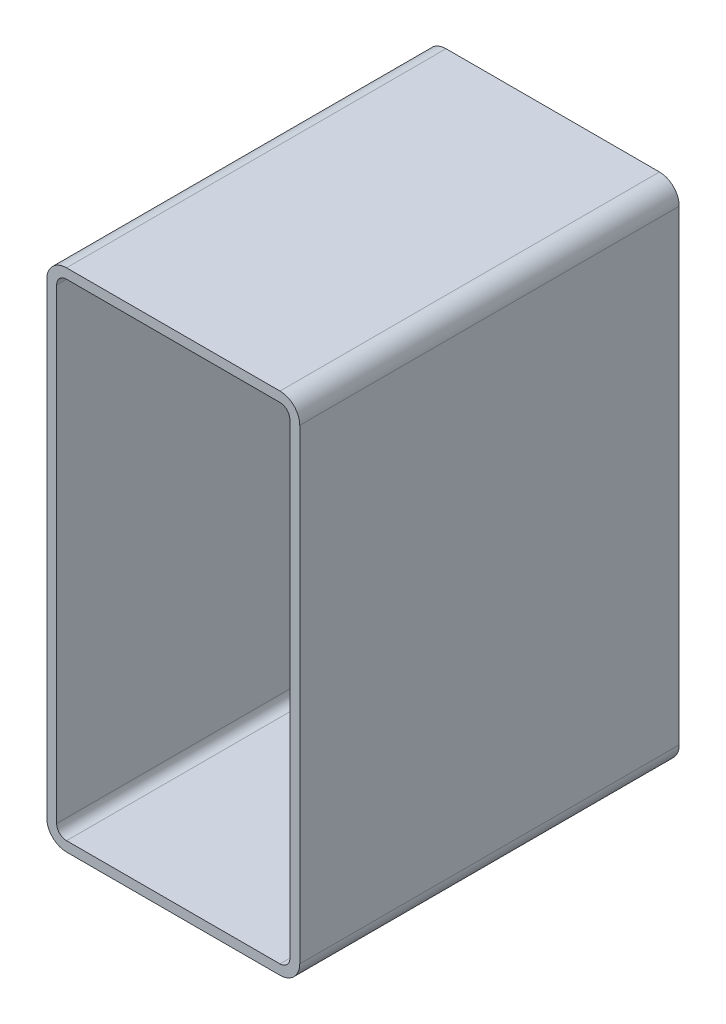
ISO-10303-21;
HEADER;
FILE_DESCRIPTION(('STEP AP214'),'2;1');
FILE_NAME('part.step','',(''),(''),'','','');
FILE_SCHEMA(('AUTOMOTIVE_DESIGN { 1 0 10303 214 1 1 1 1 }'));
ENDSEC;
DATA;
#1=APPLICATION_CONTEXT('core data for automotive mechanical design processes');
#2=APPLICATION_PROTOCOL_DEFINITION('international standard','automotive_design',2000,#1);
#3=PRODUCT_CONTEXT('',#1,'mechanical');
#4=PRODUCT('Part','Part','',(#3));
#5=PRODUCT_RELATED_PRODUCT_CATEGORY('part','',(#4));
#6=PRODUCT_DEFINITION_FORMATION('','',#4);
#7=PRODUCT_DEFINITION_CONTEXT('part definition',#1,'design');
#8=PRODUCT_DEFINITION('design','',#6,#7);
#9=PRODUCT_DEFINITION_SHAPE('','',#8);
#10=(LENGTH_UNIT() NAMED_UNIT(*) SI_UNIT(.MILLI.,.METRE.));
#11=(NAMED_UNIT(*) PLANE_ANGLE_UNIT() SI_UNIT($,.RADIAN.));
#12=(NAMED_UNIT(*) SI_UNIT($,.STERADIAN.) SOLID_ANGLE_UNIT());
#13=UNCERTAINTY_MEASURE_WITH_UNIT(LENGTH_MEASURE(1.E-05),#10,'distance_accuracy_value','');
#14=(GEOMETRIC_REPRESENTATION_CONTEXT(3) GLOBAL_UNCERTAINTY_ASSIGNED_CONTEXT((#13)) GLOBAL_UNIT_ASSIGNED_CONTEXT((#10,
#11,#12)) REPRESENTATION_CONTEXT('',''));
#15=CARTESIAN_POINT('',(0.,0.,0.));
#16=DIRECTION('',(0.,0.,1.));
#17=DIRECTION('',(1.,0.,0.));
#18=AXIS2_PLACEMENT_3D('',#15,#16,#17);
#19=CARTESIAN_POINT('',(17.2659404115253,392.307862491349,304.8));
#20=DIRECTION('',(0.,0.,1.));
#21=DIRECTION('',(1.,0.,0.));
#22=AXIS2_PLACEMENT_3D('',#19,#20,#21);
#23=PLANE('',#22);
#24=CARTESIAN_POINT('',(17.2659404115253,392.307862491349,304.8));
#25=DIRECTION('',(0.,0.,1.));
#26=DIRECTION('',(1.,0.,0.));
#27=AXIS2_PLACEMENT_3D('',#24,#25,#26);
#28=CIRCLE('',#27,15.875);
#29=CARTESIAN_POINT('',(17.2659404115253,408.182862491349,304.8));
#30=VERTEX_POINT('',#29);
#31=CARTESIAN_POINT('',(1.3909404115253,392.307862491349,304.8));
#32=VERTEX_POINT('',#31);
#33=EDGE_CURVE('E211',#30,#32,#28,.T.);
#34=ORIENTED_EDGE('',*,*,#33,.T.);
#35=DIRECTION('',(0.,-1.,0.));
#36=VECTOR('',#35,1.);
#37=CARTESIAN_POINT('',(1.3909404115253,17.6578624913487,304.8));
#38=LINE('',#37,#36);
#39=CARTESIAN_POINT('',(1.3909404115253,17.6578624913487,304.8));
#40=VERTEX_POINT('',#39);
#41=EDGE_CURVE('E214',#32,#40,#38,.T.);
#42=ORIENTED_EDGE('',*,*,#41,.T.);
#43=CARTESIAN_POINT('',(17.2659404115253,17.6578624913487,304.8));
#44=DIRECTION('',(0.,0.,1.));
#45=DIRECTION('',(1.,0.,0.));
#46=AXIS2_PLACEMENT_3D('',#43,#44,#45);
#47=CIRCLE('',#46,15.875);
#48=CARTESIAN_POINT('',(17.2659404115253,1.78286249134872,304.8));
#49=VERTEX_POINT('',#48);
#50=EDGE_CURVE('E217',#40,#49,#47,.T.);
#51=ORIENTED_EDGE('',*,*,#50,.T.);
#52=DIRECTION('',(1.,0.,0.));
#53=VECTOR('',#52,1.);
#54=CARTESIAN_POINT('',(188.715940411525,1.78286249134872,304.8));
#55=LINE('',#54,#53);
#56=CARTESIAN_POINT('',(188.715940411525,1.7828624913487,304.8));
#57=VERTEX_POINT('',#56);
#58=EDGE_CURVE('E219',#49,#57,#55,.T.);
#59=ORIENTED_EDGE('',*,*,#58,.T.);
#60=CARTESIAN_POINT('',(188.715940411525,17.6578624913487,304.8));
#61=DIRECTION('',(0.,0.,1.));
#62=DIRECTION('',(1.,0.,0.));
#63=AXIS2_PLACEMENT_3D('',#60,#61,#62);
#64=CIRCLE('',#63,15.875);
#65=CARTESIAN_POINT('',(204.590940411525,17.6578624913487,304.8));
#66=VERTEX_POINT('',#65);
#67=EDGE_CURVE('E221',#57,#66,#64,.T.);
#68=ORIENTED_EDGE('',*,*,#67,.T.);
#69=DIRECTION('',(0.,1.,0.));
#70=VECTOR('',#69,1.);
#71=CARTESIAN_POINT('',(204.590940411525,392.307862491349,304.8));
#72=LINE('',#71,#70);
#73=CARTESIAN_POINT('',(204.590940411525,392.307862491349,304.8));
#74=VERTEX_POINT('',#73);
#75=EDGE_CURVE('E223',#66,#74,#72,.T.);
#76=ORIENTED_EDGE('',*,*,#75,.T.);
#77=CARTESIAN_POINT('',(188.715940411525,392.307862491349,304.8));
#78=DIRECTION('',(0.,0.,1.));
#79=DIRECTION('',(1.,0.,0.));
#80=AXIS2_PLACEMENT_3D('',#77,#78,#79);
#81=CIRCLE('',#80,15.875);
#82=CARTESIAN_POINT('',(188.715940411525,408.182862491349,304.8));
#83=VERTEX_POINT('',#82);
#84=EDGE_CURVE('E225',#74,#83,#81,.T.);
#85=ORIENTED_EDGE('',*,*,#84,.T.);
#86=DIRECTION('',(-1.,0.,0.));
#87=VECTOR('',#86,1.);
#88=CARTESIAN_POINT('',(17.2659404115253,408.182862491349,304.8));
#89=LINE('',#88,#87);
#90=EDGE_CURVE('E227',#83,#30,#89,.T.);
#91=ORIENTED_EDGE('',*,*,#90,.T.);
#92=EDGE_LOOP('',(#34,#42,#51,#59,#68,#76,#85,#91));
#93=FACE_BOUND('',#92,.T.);
#94=DIRECTION('',(0.,-1.,0.));
#95=VECTOR('',#94,1.);
#96=CARTESIAN_POINT('',(9.3284404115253,17.6578624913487,304.8));
#97=LINE('',#96,#95);
#98=CARTESIAN_POINT('',(9.3284404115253,392.307862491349,304.8));
#99=VERTEX_POINT('',#98);
#100=CARTESIAN_POINT('',(9.3284404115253,17.6578624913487,304.8));
#101=VERTEX_POINT('',#100);
#102=EDGE_CURVE('E154',#99,#101,#97,.T.);
#103=ORIENTED_EDGE('',*,*,#102,.F.);
#104=CARTESIAN_POINT('',(17.2659404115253,392.307862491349,304.8));
#105=DIRECTION('',(0.,0.,1.));
#106=DIRECTION('',(1.,0.,0.));
#107=AXIS2_PLACEMENT_3D('',#104,#105,#106);
#108=CIRCLE('',#107,7.9375);
#109=CARTESIAN_POINT('',(17.2659404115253,400.245362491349,304.8));
#110=VERTEX_POINT('',#109);
#111=EDGE_CURVE('E146',#110,#99,#108,.T.);
#112=ORIENTED_EDGE('',*,*,#111,.F.);
#113=DIRECTION('',(-1.,0.,0.));
#114=VECTOR('',#113,1.);
#115=CARTESIAN_POINT('',(17.2659404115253,400.245362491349,304.8));
#116=LINE('',#115,#114);
#117=CARTESIAN_POINT('',(188.715940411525,400.245362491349,304.8));
#118=VERTEX_POINT('',#117);
#119=EDGE_CURVE('E179',#118,#110,#116,.T.);
#120=ORIENTED_EDGE('',*,*,#119,.F.);
#121=CARTESIAN_POINT('',(188.715940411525,392.307862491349,304.8));
#122=DIRECTION('',(0.,0.,1.));
#123=DIRECTION('',(1.,0.,0.));
#124=AXIS2_PLACEMENT_3D('',#121,#122,#123);
#125=CIRCLE('',#124,7.93750000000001);
#126=CARTESIAN_POINT('',(196.653440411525,392.307862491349,304.8));
#127=VERTEX_POINT('',#126);
#128=EDGE_CURVE('E177',#127,#118,#125,.T.);
#129=ORIENTED_EDGE('',*,*,#128,.F.);
#130=DIRECTION('',(0.,1.,0.));
#131=VECTOR('',#130,1.);
#132=CARTESIAN_POINT('',(196.653440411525,392.307862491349,304.8));
#133=LINE('',#132,#131);
#134=CARTESIAN_POINT('',(196.653440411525,17.6578624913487,304.8));
#135=VERTEX_POINT('',#134);
#136=EDGE_CURVE('E175',#135,#127,#133,.T.);
#137=ORIENTED_EDGE('',*,*,#136,.F.);
#138=CARTESIAN_POINT('',(188.715940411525,17.6578624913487,304.8));
#139=DIRECTION('',(0.,0.,1.));
#140=DIRECTION('',(1.,0.,0.));
#141=AXIS2_PLACEMENT_3D('',#138,#139,#140);
#142=CIRCLE('',#141,7.93750000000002);
#143=CARTESIAN_POINT('',(188.715940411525,9.7203624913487,304.8));
#144=VERTEX_POINT('',#143);
#145=EDGE_CURVE('E173',#144,#135,#142,.T.);
#146=ORIENTED_EDGE('',*,*,#145,.F.);
#147=DIRECTION('',(1.,0.,0.));
#148=VECTOR('',#147,1.);
#149=CARTESIAN_POINT('',(188.715940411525,9.72036249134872,304.8));
#150=LINE('',#149,#148);
#151=CARTESIAN_POINT('',(17.2659404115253,9.72036249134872,304.8));
#152=VERTEX_POINT('',#151);
#153=EDGE_CURVE('E169',#152,#144,#150,.T.);
#154=ORIENTED_EDGE('',*,*,#153,.F.);
#155=CARTESIAN_POINT('',(17.2659404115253,17.6578624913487,304.8));
#156=DIRECTION('',(0.,0.,1.));
#157=DIRECTION('',(1.,0.,0.));
#158=AXIS2_PLACEMENT_3D('',#155,#156,#157);
#159=CIRCLE('',#158,7.9375);
#160=EDGE_CURVE('E167',#101,#152,#159,.T.);
#161=ORIENTED_EDGE('',*,*,#160,.F.);
#162=EDGE_LOOP('',(#103,#112,#120,#129,#137,#146,#154,#161));
#163=FACE_BOUND('',#162,.T.);
#164=ADVANCED_FACE('F33',(#93,#163),#23,.T.);
#165=CARTESIAN_POINT('',(17.2659404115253,392.307862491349,0.));
#166=DIRECTION('',(0.,0.,1.));
#167=DIRECTION('',(1.,0.,0.));
#168=AXIS2_PLACEMENT_3D('',#165,#166,#167);
#169=PLANE('',#168);
#170=CARTESIAN_POINT('',(17.2659404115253,392.307862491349,0.));
#171=DIRECTION('',(0.,0.,1.));
#172=DIRECTION('',(1.,0.,0.));
#173=AXIS2_PLACEMENT_3D('',#170,#171,#172);
#174=CIRCLE('',#173,15.875);
#175=CARTESIAN_POINT('',(17.2659404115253,408.182862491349,0.));
#176=VERTEX_POINT('',#175);
#177=CARTESIAN_POINT('',(1.3909404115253,392.307862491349,0.));
#178=VERTEX_POINT('',#177);
#179=EDGE_CURVE('E162',#176,#178,#174,.T.);
#180=ORIENTED_EDGE('',*,*,#179,.F.);
#181=DIRECTION('',(-1.,0.,0.));
#182=VECTOR('',#181,1.);
#183=CARTESIAN_POINT('',(17.2659404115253,408.182862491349,0.));
#184=LINE('',#183,#182);
#185=CARTESIAN_POINT('',(188.715940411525,408.182862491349,0.));
#186=VERTEX_POINT('',#185);
#187=EDGE_CURVE('E215',#186,#176,#184,.T.);
#188=ORIENTED_EDGE('',*,*,#187,.F.);
#189=CARTESIAN_POINT('',(188.715940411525,392.307862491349,0.));
#190=DIRECTION('',(0.,0.,1.));
#191=DIRECTION('',(1.,0.,0.));
#192=AXIS2_PLACEMENT_3D('',#189,#190,#191);
#193=CIRCLE('',#192,15.875);
#194=CARTESIAN_POINT('',(204.590940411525,392.307862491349,0.));
#195=VERTEX_POINT('',#194);
#196=EDGE_CURVE('E242',#195,#186,#193,.T.);
#197=ORIENTED_EDGE('',*,*,#196,.F.);
#198=DIRECTION('',(0.,1.,0.));
#199=VECTOR('',#198,1.);
#200=CARTESIAN_POINT('',(204.590940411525,392.307862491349,0.));
#201=LINE('',#200,#199);
#202=CARTESIAN_POINT('',(204.590940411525,17.6578624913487,0.));
#203=VERTEX_POINT('',#202);
#204=EDGE_CURVE('E240',#203,#195,#201,.T.);
#205=ORIENTED_EDGE('',*,*,#204,.F.);
#206=CARTESIAN_POINT('',(188.715940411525,17.6578624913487,0.));
#207=DIRECTION('',(0.,0.,1.));
#208=DIRECTION('',(1.,0.,0.));
#209=AXIS2_PLACEMENT_3D('',#206,#207,#208);
#210=CIRCLE('',#209,15.875);
#211=CARTESIAN_POINT('',(188.715940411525,1.7828624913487,0.));
#212=VERTEX_POINT('',#211);
#213=EDGE_CURVE('E238',#212,#203,#210,.T.);
#214=ORIENTED_EDGE('',*,*,#213,.F.);
#215=DIRECTION('',(1.,0.,0.));
#216=VECTOR('',#215,1.);
#217=CARTESIAN_POINT('',(188.715940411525,1.78286249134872,0.));
#218=LINE('',#217,#216);
#219=CARTESIAN_POINT('',(17.2659404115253,1.78286249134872,0.));
#220=VERTEX_POINT('',#219);
#221=EDGE_CURVE('E236',#220,#212,#218,.T.);
#222=ORIENTED_EDGE('',*,*,#221,.F.);
#223=CARTESIAN_POINT('',(17.2659404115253,17.6578624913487,0.));
#224=DIRECTION('',(0.,0.,1.));
#225=DIRECTION('',(1.,0.,0.));
#226=AXIS2_PLACEMENT_3D('',#223,#224,#225);
#227=CIRCLE('',#226,15.875);
#228=CARTESIAN_POINT('',(1.3909404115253,17.6578624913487,0.));
#229=VERTEX_POINT('',#228);
#230=EDGE_CURVE('E234',#229,#220,#227,.T.);
#231=ORIENTED_EDGE('',*,*,#230,.F.);
#232=DIRECTION('',(0.,-1.,0.));
#233=VECTOR('',#232,1.);
#234=CARTESIAN_POINT('',(1.3909404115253,17.6578624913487,0.));
#235=LINE('',#234,#233);
#236=EDGE_CURVE('E232',#178,#229,#235,.T.);
#237=ORIENTED_EDGE('',*,*,#236,.F.);
#238=EDGE_LOOP('',(#180,#188,#197,#205,#214,#222,#231,#237));
#239=FACE_BOUND('',#238,.T.);
#240=CARTESIAN_POINT('',(17.2659404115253,392.307862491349,0.));
#241=DIRECTION('',(0.,0.,1.));
#242=DIRECTION('',(1.,0.,0.));
#243=AXIS2_PLACEMENT_3D('',#240,#241,#242);
#244=CIRCLE('',#243,7.9375);
#245=CARTESIAN_POINT('',(17.2659404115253,400.245362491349,0.));
#246=VERTEX_POINT('',#245);
#247=CARTESIAN_POINT('',(9.3284404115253,392.307862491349,0.));
#248=VERTEX_POINT('',#247);
#249=EDGE_CURVE('E56',#246,#248,#244,.T.);
#250=ORIENTED_EDGE('',*,*,#249,.T.);
#251=DIRECTION('',(0.,-1.,0.));
#252=VECTOR('',#251,1.);
#253=CARTESIAN_POINT('',(9.3284404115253,17.6578624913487,0.));
#254=LINE('',#253,#252);
#255=CARTESIAN_POINT('',(9.3284404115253,17.6578624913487,0.));
#256=VERTEX_POINT('',#255);
#257=EDGE_CURVE('E161',#248,#256,#254,.T.);
#258=ORIENTED_EDGE('',*,*,#257,.T.);
#259=CARTESIAN_POINT('',(17.2659404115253,17.6578624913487,0.));
#260=DIRECTION('',(0.,0.,1.));
#261=DIRECTION('',(1.,0.,0.));
#262=AXIS2_PLACEMENT_3D('',#259,#260,#261);
#263=CIRCLE('',#262,7.9375);
#264=CARTESIAN_POINT('',(17.2659404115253,9.72036249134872,0.));
#265=VERTEX_POINT('',#264);
#266=EDGE_CURVE('E183',#256,#265,#263,.T.);
#267=ORIENTED_EDGE('',*,*,#266,.T.);
#268=DIRECTION('',(1.,0.,0.));
#269=VECTOR('',#268,1.);
#270=CARTESIAN_POINT('',(188.715940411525,9.72036249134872,0.));
#271=LINE('',#270,#269);
#272=CARTESIAN_POINT('',(188.715940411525,9.7203624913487,0.));
#273=VERTEX_POINT('',#272);
#274=EDGE_CURVE('E186',#265,#273,#271,.T.);
#275=ORIENTED_EDGE('',*,*,#274,.T.);
#276=CARTESIAN_POINT('',(188.715940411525,17.6578624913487,0.));
#277=DIRECTION('',(0.,0.,1.));
#278=DIRECTION('',(1.,0.,0.));
#279=AXIS2_PLACEMENT_3D('',#276,#277,#278);
#280=CIRCLE('',#279,7.93750000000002);
#281=CARTESIAN_POINT('',(196.653440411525,17.6578624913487,0.));
#282=VERTEX_POINT('',#281);
#283=EDGE_CURVE('E189',#273,#282,#280,.T.);
#284=ORIENTED_EDGE('',*,*,#283,.T.);
#285=DIRECTION('',(0.,1.,0.));
#286=VECTOR('',#285,1.);
#287=CARTESIAN_POINT('',(196.653440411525,392.307862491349,0.));
#288=LINE('',#287,#286);
#289=CARTESIAN_POINT('',(196.653440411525,392.307862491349,0.));
#290=VERTEX_POINT('',#289);
#291=EDGE_CURVE('E192',#282,#290,#288,.T.);
#292=ORIENTED_EDGE('',*,*,#291,.T.);
#293=CARTESIAN_POINT('',(188.715940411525,392.307862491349,0.));
#294=DIRECTION('',(0.,0.,1.));
#295=DIRECTION('',(1.,0.,0.));
#296=AXIS2_PLACEMENT_3D('',#293,#294,#295);
#297=CIRCLE('',#296,7.93750000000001);
#298=CARTESIAN_POINT('',(188.715940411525,400.245362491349,0.));
#299=VERTEX_POINT('',#298);
#300=EDGE_CURVE('E195',#290,#299,#297,.T.);
#301=ORIENTED_EDGE('',*,*,#300,.T.);
#302=DIRECTION('',(-1.,0.,0.));
#303=VECTOR('',#302,1.);
#304=CARTESIAN_POINT('',(17.2659404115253,400.245362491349,0.));
#305=LINE('',#304,#303);
#306=EDGE_CURVE('E155',#299,#246,#305,.T.);
#307=ORIENTED_EDGE('',*,*,#306,.T.);
#308=EDGE_LOOP('',(#250,#258,#267,#275,#284,#292,#301,#307));
#309=FACE_BOUND('',#308,.T.);
#310=ADVANCED_FACE('F272',(#239,#309),#169,.F.);
#311=CARTESIAN_POINT('',(17.2659404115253,392.307862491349,304.8));
#312=DIRECTION('',(0.,0.,-1.));
#313=DIRECTION('',(-1.,0.,0.));
#314=AXIS2_PLACEMENT_3D('',#311,#312,#313);
#315=CYLINDRICAL_SURFACE('',#314,15.875);
#316=ORIENTED_EDGE('',*,*,#179,.T.);
#317=DIRECTION('',(0.,0.,-1.));
#318=VECTOR('',#317,1.);
#319=CARTESIAN_POINT('',(1.3909404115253,392.307862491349,304.8));
#320=LINE('',#319,#318);
#321=EDGE_CURVE('E11',#32,#178,#320,.T.);
#322=ORIENTED_EDGE('',*,*,#321,.F.);
#323=ORIENTED_EDGE('',*,*,#33,.F.);
#324=DIRECTION('',(0.,0.,-1.));
#325=VECTOR('',#324,1.);
#326=CARTESIAN_POINT('',(17.2659404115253,408.182862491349,304.8));
#327=LINE('',#326,#325);
#328=EDGE_CURVE('E229',#30,#176,#327,.T.);
#329=ORIENTED_EDGE('',*,*,#328,.T.);
#330=EDGE_LOOP('',(#316,#322,#323,#329));
#331=FACE_BOUND('',#330,.T.);
#332=ADVANCED_FACE('F35',(#331),#315,.T.);
#333=CARTESIAN_POINT('',(1.3909404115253,17.6578624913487,304.8));
#334=DIRECTION('',(1.,0.,0.));
#335=DIRECTION('',(0.,0.,-1.));
#336=AXIS2_PLACEMENT_3D('',#333,#334,#335);
#337=PLANE('',#336);
#338=ORIENTED_EDGE('',*,*,#236,.T.);
#339=DIRECTION('',(0.,0.,-1.));
#340=VECTOR('',#339,1.);
#341=CARTESIAN_POINT('',(1.3909404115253,17.6578624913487,304.8));
#342=LINE('',#341,#340);
#343=EDGE_CURVE('E41',#40,#229,#342,.T.);
#344=ORIENTED_EDGE('',*,*,#343,.F.);
#345=ORIENTED_EDGE('',*,*,#41,.F.);
#346=ORIENTED_EDGE('',*,*,#321,.T.);
#347=EDGE_LOOP('',(#338,#344,#345,#346));
#348=FACE_BOUND('',#347,.T.);
#349=ADVANCED_FACE('F289',(#348),#337,.F.);
#350=CARTESIAN_POINT('',(17.2659404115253,17.6578624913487,304.8));
#351=DIRECTION('',(0.,0.,-1.));
#352=DIRECTION('',(-1.,0.,0.));
#353=AXIS2_PLACEMENT_3D('',#350,#351,#352);
#354=CYLINDRICAL_SURFACE('',#353,15.875);
#355=ORIENTED_EDGE('',*,*,#230,.T.);
#356=DIRECTION('',(0.,0.,-1.));
#357=VECTOR('',#356,1.);
#358=CARTESIAN_POINT('',(17.2659404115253,1.78286249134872,304.8));
#359=LINE('',#358,#357);
#360=EDGE_CURVE('E259',#49,#220,#359,.T.);
#361=ORIENTED_EDGE('',*,*,#360,.F.);
#362=ORIENTED_EDGE('',*,*,#50,.F.);
#363=ORIENTED_EDGE('',*,*,#343,.T.);
#364=EDGE_LOOP('',(#355,#361,#362,#363));
#365=FACE_BOUND('',#364,.T.);
#366=ADVANCED_FACE('F266',(#365),#354,.T.);
#367=CARTESIAN_POINT('',(188.715940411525,1.78286249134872,304.8));
#368=DIRECTION('',(0.,1.,0.));
#369=DIRECTION('',(0.,0.,1.));
#370=AXIS2_PLACEMENT_3D('',#367,#368,#369);
#371=PLANE('',#370);
#372=ORIENTED_EDGE('',*,*,#221,.T.);
#373=DIRECTION('',(0.,0.,-1.));
#374=VECTOR('',#373,1.);
#375=CARTESIAN_POINT('',(188.715940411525,1.7828624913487,304.8));
#376=LINE('',#375,#374);
#377=EDGE_CURVE('E256',#57,#212,#376,.T.);
#378=ORIENTED_EDGE('',*,*,#377,.F.);
#379=ORIENTED_EDGE('',*,*,#58,.F.);
#380=ORIENTED_EDGE('',*,*,#360,.T.);
#381=EDGE_LOOP('',(#372,#378,#379,#380));
#382=FACE_BOUND('',#381,.T.);
#383=ADVANCED_FACE('F278',(#382),#371,.F.);
#384=CARTESIAN_POINT('',(188.715940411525,17.6578624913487,304.8));
#385=DIRECTION('',(0.,0.,-1.));
#386=DIRECTION('',(-1.,0.,0.));
#387=AXIS2_PLACEMENT_3D('',#384,#385,#386);
#388=CYLINDRICAL_SURFACE('',#387,15.875);
#389=ORIENTED_EDGE('',*,*,#213,.T.);
#390=DIRECTION('',(0.,0.,-1.));
#391=VECTOR('',#390,1.);
#392=CARTESIAN_POINT('',(204.590940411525,17.6578624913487,304.8));
#393=LINE('',#392,#391);
#394=EDGE_CURVE('E253',#66,#203,#393,.T.);
#395=ORIENTED_EDGE('',*,*,#394,.F.);
#396=ORIENTED_EDGE('',*,*,#67,.F.);
#397=ORIENTED_EDGE('',*,*,#377,.T.);
#398=EDGE_LOOP('',(#389,#395,#396,#397));
#399=FACE_BOUND('',#398,.T.);
#400=ADVANCED_FACE('F282',(#399),#388,.T.);
#401=CARTESIAN_POINT('',(204.590940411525,392.307862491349,304.8));
#402=DIRECTION('',(-1.,0.,0.));
#403=DIRECTION('',(0.,0.,1.));
#404=AXIS2_PLACEMENT_3D('',#401,#402,#403);
#405=PLANE('',#404);
#406=ORIENTED_EDGE('',*,*,#204,.T.);
#407=DIRECTION('',(0.,0.,-1.));
#408=VECTOR('',#407,1.);
#409=CARTESIAN_POINT('',(204.590940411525,392.307862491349,304.8));
#410=LINE('',#409,#408);
#411=EDGE_CURVE('E250',#74,#195,#410,.T.);
#412=ORIENTED_EDGE('',*,*,#411,.F.);
#413=ORIENTED_EDGE('',*,*,#75,.F.);
#414=ORIENTED_EDGE('',*,*,#394,.T.);
#415=EDGE_LOOP('',(#406,#412,#413,#414));
#416=FACE_BOUND('',#415,.T.);
#417=ADVANCED_FACE('F302',(#416),#405,.F.);
#418=CARTESIAN_POINT('',(188.715940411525,392.307862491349,304.8));
#419=DIRECTION('',(0.,0.,-1.));
#420=DIRECTION('',(-1.,0.,0.));
#421=AXIS2_PLACEMENT_3D('',#418,#419,#420);
#422=CYLINDRICAL_SURFACE('',#421,15.875);
#423=ORIENTED_EDGE('',*,*,#196,.T.);
#424=DIRECTION('',(0.,0.,-1.));
#425=VECTOR('',#424,1.);
#426=CARTESIAN_POINT('',(188.715940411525,408.182862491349,304.8));
#427=LINE('',#426,#425);
#428=EDGE_CURVE('E247',#83,#186,#427,.T.);
#429=ORIENTED_EDGE('',*,*,#428,.F.);
#430=ORIENTED_EDGE('',*,*,#84,.F.);
#431=ORIENTED_EDGE('',*,*,#411,.T.);
#432=EDGE_LOOP('',(#423,#429,#430,#431));
#433=FACE_BOUND('',#432,.T.);
#434=ADVANCED_FACE('F300',(#433),#422,.T.);
#435=CARTESIAN_POINT('',(17.2659404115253,408.182862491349,304.8));
#436=DIRECTION('',(0.,-1.,0.));
#437=DIRECTION('',(0.,0.,-1.));
#438=AXIS2_PLACEMENT_3D('',#435,#436,#437);
#439=PLANE('',#438);
#440=ORIENTED_EDGE('',*,*,#187,.T.);
#441=ORIENTED_EDGE('',*,*,#328,.F.);
#442=ORIENTED_EDGE('',*,*,#90,.F.);
#443=ORIENTED_EDGE('',*,*,#428,.T.);
#444=EDGE_LOOP('',(#440,#441,#442,#443));
#445=FACE_BOUND('',#444,.T.);
#446=ADVANCED_FACE('F295',(#445),#439,.F.);
#447=CARTESIAN_POINT('',(17.2659404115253,392.307862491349,304.8));
#448=DIRECTION('',(0.,0.,-1.));
#449=DIRECTION('',(-1.,0.,0.));
#450=AXIS2_PLACEMENT_3D('',#447,#448,#449);
#451=CYLINDRICAL_SURFACE('',#450,7.9375);
#452=ORIENTED_EDGE('',*,*,#249,.F.);
#453=DIRECTION('',(0.,0.,-1.));
#454=VECTOR('',#453,1.);
#455=CARTESIAN_POINT('',(17.2659404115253,400.245362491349,304.8));
#456=LINE('',#455,#454);
#457=EDGE_CURVE('E150',#110,#246,#456,.T.);
#458=ORIENTED_EDGE('',*,*,#457,.F.);
#459=ORIENTED_EDGE('',*,*,#111,.T.);
#460=DIRECTION('',(0.,0.,-1.));
#461=VECTOR('',#460,1.);
#462=CARTESIAN_POINT('',(9.3284404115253,392.307862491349,304.8));
#463=LINE('',#462,#461);
#464=EDGE_CURVE('E149',#99,#248,#463,.T.);
#465=ORIENTED_EDGE('',*,*,#464,.T.);
#466=EDGE_LOOP('',(#452,#458,#459,#465));
#467=FACE_BOUND('',#466,.T.);
#468=ADVANCED_FACE('F148',(#467),#451,.F.);
#469=CARTESIAN_POINT('',(9.3284404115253,17.6578624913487,304.8));
#470=DIRECTION('',(1.,0.,0.));
#471=DIRECTION('',(0.,0.,-1.));
#472=AXIS2_PLACEMENT_3D('',#469,#470,#471);
#473=PLANE('',#472);
#474=ORIENTED_EDGE('',*,*,#257,.F.);
#475=ORIENTED_EDGE('',*,*,#464,.F.);
#476=ORIENTED_EDGE('',*,*,#102,.T.);
#477=DIRECTION('',(0.,0.,-1.));
#478=VECTOR('',#477,1.);
#479=CARTESIAN_POINT('',(9.3284404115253,17.6578624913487,304.8));
#480=LINE('',#479,#478);
#481=EDGE_CURVE('E163',#101,#256,#480,.T.);
#482=ORIENTED_EDGE('',*,*,#481,.T.);
#483=EDGE_LOOP('',(#474,#475,#476,#482));
#484=FACE_BOUND('',#483,.T.);
#485=ADVANCED_FACE('F158',(#484),#473,.T.);
#486=CARTESIAN_POINT('',(17.2659404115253,17.6578624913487,304.8));
#487=DIRECTION('',(0.,0.,-1.));
#488=DIRECTION('',(-1.,0.,0.));
#489=AXIS2_PLACEMENT_3D('',#486,#487,#488);
#490=CYLINDRICAL_SURFACE('',#489,7.9375);
#491=ORIENTED_EDGE('',*,*,#266,.F.);
#492=ORIENTED_EDGE('',*,*,#481,.F.);
#493=ORIENTED_EDGE('',*,*,#160,.T.);
#494=DIRECTION('',(0.,0.,-1.));
#495=VECTOR('',#494,1.);
#496=CARTESIAN_POINT('',(17.2659404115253,9.72036249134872,304.8));
#497=LINE('',#496,#495);
#498=EDGE_CURVE('E208',#152,#265,#497,.T.);
#499=ORIENTED_EDGE('',*,*,#498,.T.);
#500=EDGE_LOOP('',(#491,#492,#493,#499));
#501=FACE_BOUND('',#500,.T.);
#502=ADVANCED_FACE('F327',(#501),#490,.F.);
#503=CARTESIAN_POINT('',(188.715940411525,9.72036249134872,304.8));
#504=DIRECTION('',(0.,1.,0.));
#505=DIRECTION('',(0.,0.,1.));
#506=AXIS2_PLACEMENT_3D('',#503,#504,#505);
#507=PLANE('',#506);
#508=ORIENTED_EDGE('',*,*,#274,.F.);
#509=ORIENTED_EDGE('',*,*,#498,.F.);
#510=ORIENTED_EDGE('',*,*,#153,.T.);
#511=DIRECTION('',(0.,0.,-1.));
#512=VECTOR('',#511,1.);
#513=CARTESIAN_POINT('',(188.715940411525,9.7203624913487,304.8));
#514=LINE('',#513,#512);
#515=EDGE_CURVE('E206',#144,#273,#514,.T.);
#516=ORIENTED_EDGE('',*,*,#515,.T.);
#517=EDGE_LOOP('',(#508,#509,#510,#516));
#518=FACE_BOUND('',#517,.T.);
#519=ADVANCED_FACE('F331',(#518),#507,.T.);
#520=CARTESIAN_POINT('',(188.715940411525,17.6578624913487,304.8));
#521=DIRECTION('',(0.,0.,-1.));
#522=DIRECTION('',(-1.,0.,0.));
#523=AXIS2_PLACEMENT_3D('',#520,#521,#522);
#524=CYLINDRICAL_SURFACE('',#523,7.93750000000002);
#525=ORIENTED_EDGE('',*,*,#283,.F.);
#526=ORIENTED_EDGE('',*,*,#515,.F.);
#527=ORIENTED_EDGE('',*,*,#145,.T.);
#528=DIRECTION('',(0.,0.,-1.));
#529=VECTOR('',#528,1.);
#530=CARTESIAN_POINT('',(196.653440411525,17.6578624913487,304.8));
#531=LINE('',#530,#529);
#532=EDGE_CURVE('E204',#135,#282,#531,.T.);
#533=ORIENTED_EDGE('',*,*,#532,.T.);
#534=EDGE_LOOP('',(#525,#526,#527,#533));
#535=FACE_BOUND('',#534,.T.);
#536=ADVANCED_FACE('F337',(#535),#524,.F.);
#537=CARTESIAN_POINT('',(196.653440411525,392.307862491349,304.8));
#538=DIRECTION('',(-1.,0.,0.));
#539=DIRECTION('',(0.,0.,1.));
#540=AXIS2_PLACEMENT_3D('',#537,#538,#539);
#541=PLANE('',#540);
#542=ORIENTED_EDGE('',*,*,#291,.F.);
#543=ORIENTED_EDGE('',*,*,#532,.F.);
#544=ORIENTED_EDGE('',*,*,#136,.T.);
#545=DIRECTION('',(0.,0.,-1.));
#546=VECTOR('',#545,1.);
#547=CARTESIAN_POINT('',(196.653440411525,392.307862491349,304.8));
#548=LINE('',#547,#546);
#549=EDGE_CURVE('E202',#127,#290,#548,.T.);
#550=ORIENTED_EDGE('',*,*,#549,.T.);
#551=EDGE_LOOP('',(#542,#543,#544,#550));
#552=FACE_BOUND('',#551,.T.);
#553=ADVANCED_FACE('F341',(#552),#541,.T.);
#554=CARTESIAN_POINT('',(188.715940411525,392.307862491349,304.8));
#555=DIRECTION('',(0.,0.,-1.));
#556=DIRECTION('',(-1.,0.,0.));
#557=AXIS2_PLACEMENT_3D('',#554,#555,#556);
#558=CYLINDRICAL_SURFACE('',#557,7.93750000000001);
#559=ORIENTED_EDGE('',*,*,#300,.F.);
#560=ORIENTED_EDGE('',*,*,#549,.F.);
#561=ORIENTED_EDGE('',*,*,#128,.T.);
#562=DIRECTION('',(0.,0.,-1.));
#563=VECTOR('',#562,1.);
#564=CARTESIAN_POINT('',(188.715940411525,400.245362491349,304.8));
#565=LINE('',#564,#563);
#566=EDGE_CURVE('E48',#118,#299,#565,.T.);
#567=ORIENTED_EDGE('',*,*,#566,.T.);
#568=EDGE_LOOP('',(#559,#560,#561,#567));
#569=FACE_BOUND('',#568,.T.);
#570=ADVANCED_FACE('F345',(#569),#558,.F.);
#571=CARTESIAN_POINT('',(17.2659404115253,400.245362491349,304.8));
#572=DIRECTION('',(0.,-1.,0.));
#573=DIRECTION('',(0.,0.,-1.));
#574=AXIS2_PLACEMENT_3D('',#571,#572,#573);
#575=PLANE('',#574);
#576=ORIENTED_EDGE('',*,*,#306,.F.);
#577=ORIENTED_EDGE('',*,*,#566,.F.);
#578=ORIENTED_EDGE('',*,*,#119,.T.);
#579=ORIENTED_EDGE('',*,*,#457,.T.);
#580=EDGE_LOOP('',(#576,#577,#578,#579));
#581=FACE_BOUND('',#580,.T.);
#582=ADVANCED_FACE('F349',(#581),#575,.T.);
#583=CLOSED_SHELL('',(#164,#310,#332,#349,#366,#383,#400,#417,#434,#446,#468,#485,#502,#519,
#536,#553,#570,#582));
#584=MANIFOLD_SOLID_BREP('B2',#583);
#585=ADVANCED_BREP_SHAPE_REPRESENTATION('',(#18,#584),#14);
#586=SHAPE_DEFINITION_REPRESENTATION(#9,#585);
ENDSEC;
END-ISO-10303-21;
